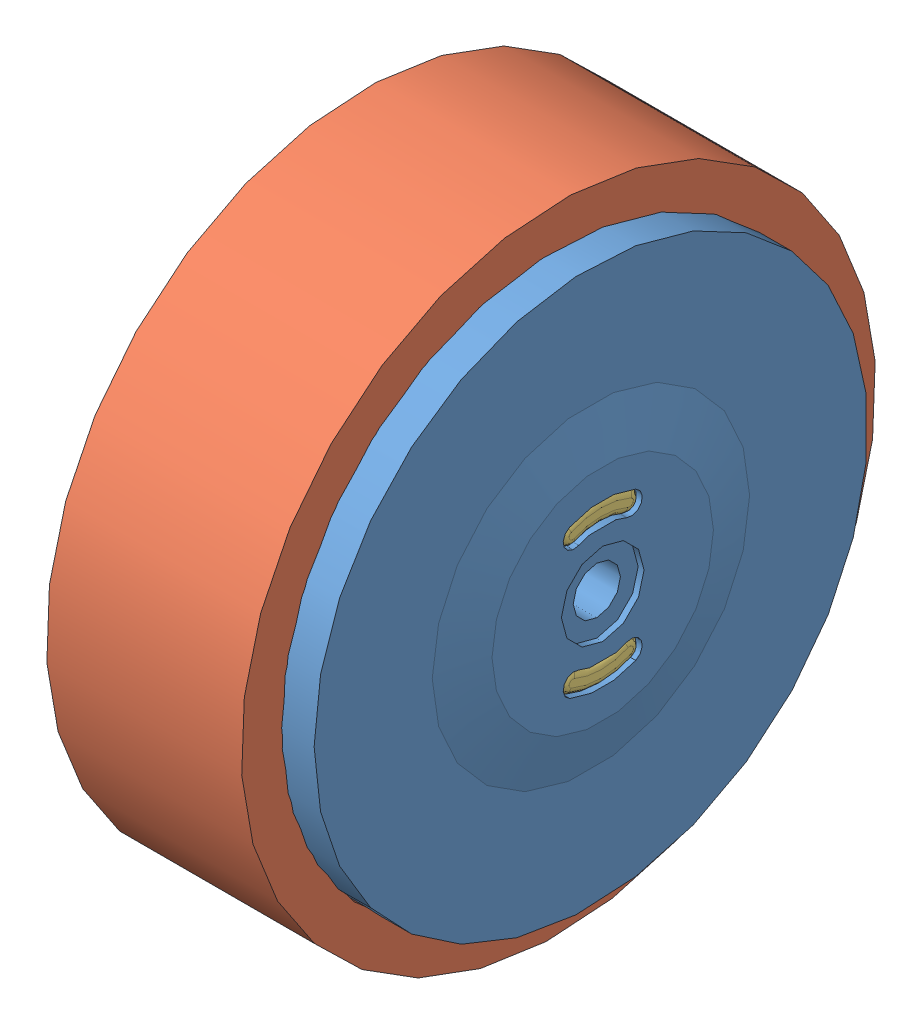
SolidWorks assembly roue.SLDASM, configuration Défaut (file format 5000). Lengths in mm.
Overall size (62.23 62.23 62.23).
3 component instances, 3 part files, 5 mates.
Components (placement in the parent):
- jante-1: jante.SLDPRT [Défaut] at origin size (17.2 39.5 39.5)
- pneu-1: pneu.SLDPRT [Défaut] at (14.2 0 0) x (0 -0.065809 0.997832) z (-1 0 0) size (43 43 13.2)
- couronne-1: couronne.SLDPRT [Défaut] at (13.05 0 0) x (0 0 1) z (-1 0 0) size (26.6 26.6 16.65)
Mates (geometry in assembly coordinates):
- Coïncidente1: coincident anti-aligned: axis of jante-1 through (16.8 0 0) axis (-1 0 0); axis of pneu-1 through (1 0 0) axis (1 0 0)
- Coïncidente2: coincident anti-aligned: plane of jante-1 through (1 19.75 0) normal (1 0 0); plane of pneu-1 through (1 0 0) normal (-1 0 0)
- Coaxiale1: concentric anti-aligned: cylinder of jante-1 through (0 0 0) axis (1 0 0) radius 5.5; cylinder of couronne-1 through (17.1 0 0) axis (-1 0 0) radius 5.5
- Coaxiale2: concentric anti-aligned: cylinder of jante-1 through (0 -4.3403 1.9298) axis (1 0 0) radius 0.75; cylinder of couronne-1 through (17.1 -4.3403 1.9298) axis (-1 0 0) radius 0.75
- Coïncidente3: coincident anti-aligned: plane of jante-1 through (14.7 16.25 0) normal (-1 0 0); plane of couronne-1 through (14.7 0 0) normal (1 0 0)
